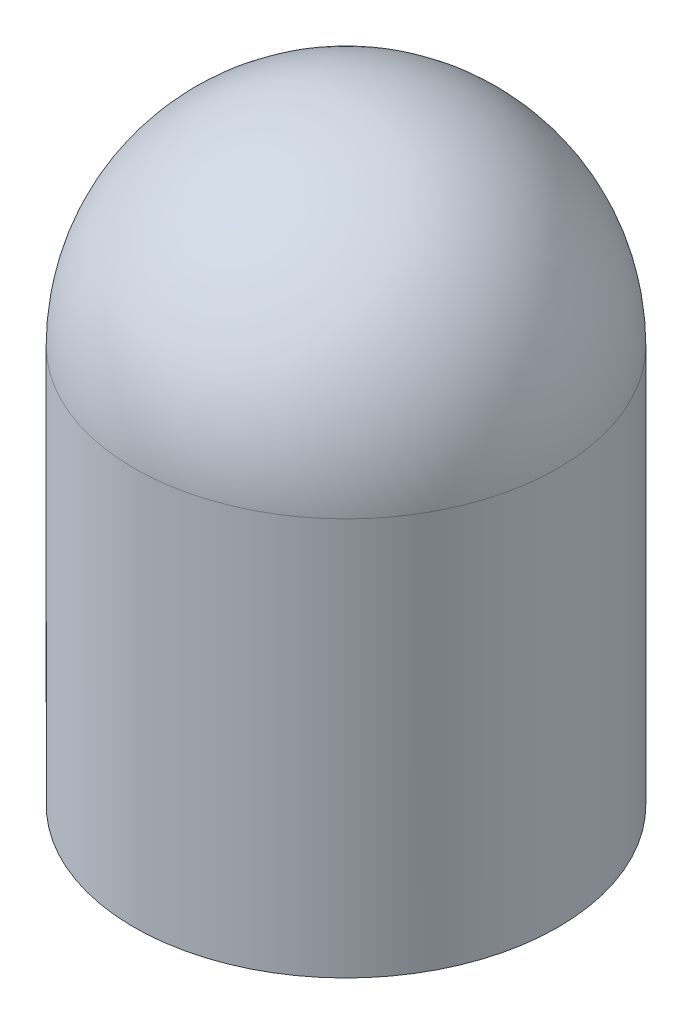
from build123d import *


with BuildPart() as part:
    # Sketch1 → Revolve1 (revolve)
    with BuildSketch(Plane.XY):
        with BuildLine():
            Line((-62.992, 0), (-62.992, -118.11))
            Line((-62.992, -118.11), (0, -118.11))
            Line((0, -118.11), (0, 62.992))
            ThreePointArc((0, 62.992), (-44.542070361, 44.542070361), (-62.992, 0))
        make_face()
    revolve(axis=Axis((0, 0, 0), (0, 1, 0)))


solid = part.part
